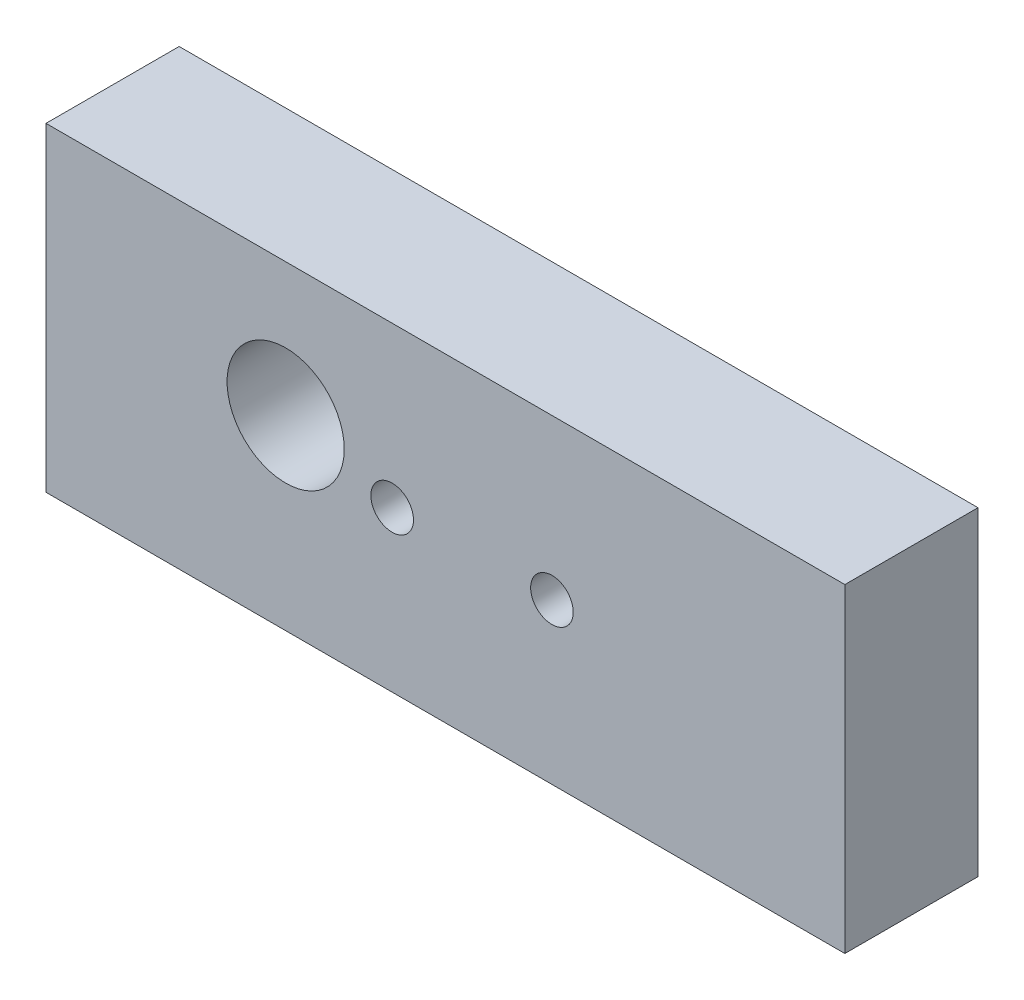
ISO-10303-21;
HEADER;
FILE_DESCRIPTION(('STEP AP214'),'2;1');
FILE_NAME('part.step','',(''),(''),'','','');
FILE_SCHEMA(('AUTOMOTIVE_DESIGN { 1 0 10303 214 1 1 1 1 }'));
ENDSEC;
DATA;
#1=APPLICATION_CONTEXT('core data for automotive mechanical design processes');
#2=APPLICATION_PROTOCOL_DEFINITION('international standard','automotive_design',2000,#1);
#3=PRODUCT_CONTEXT('',#1,'mechanical');
#4=PRODUCT('Part','Part','',(#3));
#5=PRODUCT_RELATED_PRODUCT_CATEGORY('part','',(#4));
#6=PRODUCT_DEFINITION_FORMATION('','',#4);
#7=PRODUCT_DEFINITION_CONTEXT('part definition',#1,'design');
#8=PRODUCT_DEFINITION('design','',#6,#7);
#9=PRODUCT_DEFINITION_SHAPE('','',#8);
#10=(LENGTH_UNIT() NAMED_UNIT(*) SI_UNIT(.MILLI.,.METRE.));
#11=(NAMED_UNIT(*) PLANE_ANGLE_UNIT() SI_UNIT($,.RADIAN.));
#12=(NAMED_UNIT(*) SI_UNIT($,.STERADIAN.) SOLID_ANGLE_UNIT());
#13=UNCERTAINTY_MEASURE_WITH_UNIT(LENGTH_MEASURE(1.E-05),#10,'distance_accuracy_value','');
#14=(GEOMETRIC_REPRESENTATION_CONTEXT(3) GLOBAL_UNCERTAINTY_ASSIGNED_CONTEXT((#13)) GLOBAL_UNIT_ASSIGNED_CONTEXT((#10,
#11,#12)) REPRESENTATION_CONTEXT('',''));
#15=CARTESIAN_POINT('',(0.,0.,0.));
#16=DIRECTION('',(0.,0.,1.));
#17=DIRECTION('',(1.,0.,0.));
#18=AXIS2_PLACEMENT_3D('',#15,#16,#17);
#19=CARTESIAN_POINT('',(0.,0.,-25.));
#20=DIRECTION('',(-1.,0.,0.));
#21=DIRECTION('',(0.,0.,1.));
#22=AXIS2_PLACEMENT_3D('',#19,#20,#21);
#23=PLANE('',#22);
#24=DIRECTION('',(0.,-1.,0.));
#25=VECTOR('',#24,1.);
#26=CARTESIAN_POINT('',(0.,0.,0.));
#27=LINE('',#26,#25);
#28=CARTESIAN_POINT('',(0.,60.,0.));
#29=VERTEX_POINT('',#28);
#30=CARTESIAN_POINT('',(0.,0.,0.));
#31=VERTEX_POINT('',#30);
#32=EDGE_CURVE('E102',#29,#31,#27,.T.);
#33=ORIENTED_EDGE('',*,*,#32,.F.);
#34=DIRECTION('',(0.,0.,1.));
#35=VECTOR('',#34,1.);
#36=CARTESIAN_POINT('',(0.,60.,-25.));
#37=LINE('',#36,#35);
#38=CARTESIAN_POINT('',(0.,60.,-25.));
#39=VERTEX_POINT('',#38);
#40=EDGE_CURVE('E11',#39,#29,#37,.T.);
#41=ORIENTED_EDGE('',*,*,#40,.F.);
#42=DIRECTION('',(0.,-1.,0.));
#43=VECTOR('',#42,1.);
#44=CARTESIAN_POINT('',(0.,0.,-25.));
#45=LINE('',#44,#43);
#46=CARTESIAN_POINT('',(0.,0.,-25.));
#47=VERTEX_POINT('',#46);
#48=EDGE_CURVE('E100',#39,#47,#45,.T.);
#49=ORIENTED_EDGE('',*,*,#48,.T.);
#50=DIRECTION('',(0.,0.,1.));
#51=VECTOR('',#50,1.);
#52=CARTESIAN_POINT('',(0.,0.,-25.));
#53=LINE('',#52,#51);
#54=EDGE_CURVE('E45',#47,#31,#53,.T.);
#55=ORIENTED_EDGE('',*,*,#54,.T.);
#56=EDGE_LOOP('',(#33,#41,#49,#55));
#57=FACE_BOUND('',#56,.T.);
#58=ADVANCED_FACE('F39',(#57),#23,.T.);
#59=CARTESIAN_POINT('',(0.,60.,-25.));
#60=DIRECTION('',(0.,1.,0.));
#61=DIRECTION('',(0.,0.,1.));
#62=AXIS2_PLACEMENT_3D('',#59,#60,#61);
#63=PLANE('',#62);
#64=DIRECTION('',(-1.,0.,0.));
#65=VECTOR('',#64,1.);
#66=CARTESIAN_POINT('',(0.,60.,0.));
#67=LINE('',#66,#65);
#68=CARTESIAN_POINT('',(150.,60.,0.));
#69=VERTEX_POINT('',#68);
#70=EDGE_CURVE('E97',#69,#29,#67,.T.);
#71=ORIENTED_EDGE('',*,*,#70,.F.);
#72=DIRECTION('',(0.,0.,1.));
#73=VECTOR('',#72,1.);
#74=CARTESIAN_POINT('',(150.,60.,-25.));
#75=LINE('',#74,#73);
#76=CARTESIAN_POINT('',(150.,60.,-25.));
#77=VERTEX_POINT('',#76);
#78=EDGE_CURVE('E48',#77,#69,#75,.T.);
#79=ORIENTED_EDGE('',*,*,#78,.F.);
#80=DIRECTION('',(-1.,0.,0.));
#81=VECTOR('',#80,1.);
#82=CARTESIAN_POINT('',(0.,60.,-25.));
#83=LINE('',#82,#81);
#84=EDGE_CURVE('E94',#77,#39,#83,.T.);
#85=ORIENTED_EDGE('',*,*,#84,.T.);
#86=ORIENTED_EDGE('',*,*,#40,.T.);
#87=EDGE_LOOP('',(#71,#79,#85,#86));
#88=FACE_BOUND('',#87,.T.);
#89=ADVANCED_FACE('F113',(#88),#63,.T.);
#90=CARTESIAN_POINT('',(150.,0.,-25.));
#91=DIRECTION('',(1.,0.,0.));
#92=DIRECTION('',(0.,0.,-1.));
#93=AXIS2_PLACEMENT_3D('',#90,#91,#92);
#94=PLANE('',#93);
#95=DIRECTION('',(0.,1.,0.));
#96=VECTOR('',#95,1.);
#97=CARTESIAN_POINT('',(150.,0.,0.));
#98=LINE('',#97,#96);
#99=CARTESIAN_POINT('',(150.,0.,0.));
#100=VERTEX_POINT('',#99);
#101=EDGE_CURVE('E90',#100,#69,#98,.T.);
#102=ORIENTED_EDGE('',*,*,#101,.F.);
#103=DIRECTION('',(0.,0.,1.));
#104=VECTOR('',#103,1.);
#105=CARTESIAN_POINT('',(150.,0.,-25.));
#106=LINE('',#105,#104);
#107=CARTESIAN_POINT('',(150.,0.,-25.));
#108=VERTEX_POINT('',#107);
#109=EDGE_CURVE('E82',#108,#100,#106,.T.);
#110=ORIENTED_EDGE('',*,*,#109,.F.);
#111=DIRECTION('',(0.,1.,0.));
#112=VECTOR('',#111,1.);
#113=CARTESIAN_POINT('',(150.,0.,-25.));
#114=LINE('',#113,#112);
#115=EDGE_CURVE('E87',#108,#77,#114,.T.);
#116=ORIENTED_EDGE('',*,*,#115,.T.);
#117=ORIENTED_EDGE('',*,*,#78,.T.);
#118=EDGE_LOOP('',(#102,#110,#116,#117));
#119=FACE_BOUND('',#118,.T.);
#120=ADVANCED_FACE('F88',(#119),#94,.T.);
#121=CARTESIAN_POINT('',(0.,0.,-25.));
#122=DIRECTION('',(0.,-1.,0.));
#123=DIRECTION('',(0.,0.,-1.));
#124=AXIS2_PLACEMENT_3D('',#121,#122,#123);
#125=PLANE('',#124);
#126=DIRECTION('',(1.,0.,0.));
#127=VECTOR('',#126,1.);
#128=CARTESIAN_POINT('',(0.,0.,0.));
#129=LINE('',#128,#127);
#130=EDGE_CURVE('E110',#31,#100,#129,.T.);
#131=ORIENTED_EDGE('',*,*,#130,.F.);
#132=ORIENTED_EDGE('',*,*,#54,.F.);
#133=DIRECTION('',(1.,0.,0.));
#134=VECTOR('',#133,1.);
#135=CARTESIAN_POINT('',(0.,0.,-25.));
#136=LINE('',#135,#134);
#137=EDGE_CURVE('E91',#47,#108,#136,.T.);
#138=ORIENTED_EDGE('',*,*,#137,.T.);
#139=ORIENTED_EDGE('',*,*,#109,.T.);
#140=EDGE_LOOP('',(#131,#132,#138,#139));
#141=FACE_BOUND('',#140,.T.);
#142=ADVANCED_FACE('F96',(#141),#125,.T.);
#143=CARTESIAN_POINT('',(0.,0.,-25.));
#144=DIRECTION('',(0.,0.,-1.));
#145=DIRECTION('',(-1.,0.,0.));
#146=AXIS2_PLACEMENT_3D('',#143,#144,#145);
#147=PLANE('',#146);
#148=ORIENTED_EDGE('',*,*,#48,.F.);
#149=ORIENTED_EDGE('',*,*,#84,.F.);
#150=ORIENTED_EDGE('',*,*,#115,.F.);
#151=ORIENTED_EDGE('',*,*,#137,.F.);
#152=EDGE_LOOP('',(#148,#149,#150,#151));
#153=FACE_BOUND('',#152,.T.);
#154=ADVANCED_FACE('F95',(#153),#147,.T.);
#155=CARTESIAN_POINT('',(0.,0.,0.));
#156=DIRECTION('',(0.,0.,-1.));
#157=DIRECTION('',(-1.,0.,0.));
#158=AXIS2_PLACEMENT_3D('',#155,#156,#157);
#159=PLANE('',#158);
#160=CARTESIAN_POINT('',(65.,30.,0.));
#161=DIRECTION('',(0.,0.,1.));
#162=DIRECTION('',(1.,0.,0.));
#163=AXIS2_PLACEMENT_3D('',#160,#161,#162);
#164=CIRCLE('',#163,4.00000000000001);
#165=CARTESIAN_POINT('',(69.,30.,0.));
#166=VERTEX_POINT('',#165);
#167=EDGE_CURVE('E162',#166,#166,#164,.T.);
#168=ORIENTED_EDGE('',*,*,#167,.F.);
#169=EDGE_LOOP('',(#168));
#170=FACE_BOUND('',#169,.T.);
#171=CARTESIAN_POINT('',(95.,30.,0.));
#172=DIRECTION('',(0.,0.,1.));
#173=DIRECTION('',(1.,0.,0.));
#174=AXIS2_PLACEMENT_3D('',#171,#172,#173);
#175=CIRCLE('',#174,4.00000000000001);
#176=CARTESIAN_POINT('',(99.,30.,0.));
#177=VERTEX_POINT('',#176);
#178=EDGE_CURVE('E170',#177,#177,#175,.T.);
#179=ORIENTED_EDGE('',*,*,#178,.F.);
#180=EDGE_LOOP('',(#179));
#181=FACE_BOUND('',#180,.T.);
#182=CARTESIAN_POINT('',(45.,35.,0.));
#183=DIRECTION('',(0.,0.,1.));
#184=DIRECTION('',(1.,0.,0.));
#185=AXIS2_PLACEMENT_3D('',#182,#183,#184);
#186=CIRCLE('',#185,11.);
#187=CARTESIAN_POINT('',(56.,35.,0.));
#188=VERTEX_POINT('',#187);
#189=EDGE_CURVE('E165',#188,#188,#186,.T.);
#190=ORIENTED_EDGE('',*,*,#189,.F.);
#191=EDGE_LOOP('',(#190));
#192=FACE_BOUND('',#191,.T.);
#193=ORIENTED_EDGE('',*,*,#32,.T.);
#194=ORIENTED_EDGE('',*,*,#130,.T.);
#195=ORIENTED_EDGE('',*,*,#101,.T.);
#196=ORIENTED_EDGE('',*,*,#70,.T.);
#197=EDGE_LOOP('',(#193,#194,#195,#196));
#198=FACE_BOUND('',#197,.T.);
#199=ADVANCED_FACE('F111',(#170,#181,#192,#198),#159,.F.);
#200=CARTESIAN_POINT('',(45.,35.,-20.));
#201=DIRECTION('',(0.,0.,1.));
#202=DIRECTION('',(1.,0.,0.));
#203=AXIS2_PLACEMENT_3D('',#200,#201,#202);
#204=CYLINDRICAL_SURFACE('',#203,11.);
#205=CARTESIAN_POINT('',(45.,35.,-20.));
#206=DIRECTION('',(0.,0.,1.));
#207=DIRECTION('',(1.,0.,0.));
#208=AXIS2_PLACEMENT_3D('',#205,#206,#207);
#209=CIRCLE('',#208,11.);
#210=CARTESIAN_POINT('',(56.,35.,-20.));
#211=VERTEX_POINT('',#210);
#212=EDGE_CURVE('E107',#211,#211,#209,.T.);
#213=ORIENTED_EDGE('',*,*,#212,.F.);
#214=EDGE_LOOP('',(#213));
#215=FACE_BOUND('',#214,.T.);
#216=ORIENTED_EDGE('',*,*,#189,.T.);
#217=EDGE_LOOP('',(#216));
#218=FACE_BOUND('',#217,.T.);
#219=ADVANCED_FACE('F133',(#215,#218),#204,.F.);
#220=CARTESIAN_POINT('',(45.,35.,-20.));
#221=DIRECTION('',(0.,0.,1.));
#222=DIRECTION('',(1.,0.,0.));
#223=AXIS2_PLACEMENT_3D('',#220,#221,#222);
#224=PLANE('',#223);
#225=ORIENTED_EDGE('',*,*,#212,.T.);
#226=EDGE_LOOP('',(#225));
#227=FACE_BOUND('',#226,.T.);
#228=ADVANCED_FACE('F140',(#227),#224,.T.);
#229=CARTESIAN_POINT('',(95.,30.,-20.));
#230=DIRECTION('',(0.,0.,1.));
#231=DIRECTION('',(1.,0.,0.));
#232=AXIS2_PLACEMENT_3D('',#229,#230,#231);
#233=CYLINDRICAL_SURFACE('',#232,4.00000000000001);
#234=CARTESIAN_POINT('',(95.,30.,-20.));
#235=DIRECTION('',(0.,0.,1.));
#236=DIRECTION('',(1.,0.,0.));
#237=AXIS2_PLACEMENT_3D('',#234,#235,#236);
#238=CIRCLE('',#237,4.00000000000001);
#239=CARTESIAN_POINT('',(99.,30.,-20.));
#240=VERTEX_POINT('',#239);
#241=EDGE_CURVE('E175',#240,#240,#238,.T.);
#242=ORIENTED_EDGE('',*,*,#241,.F.);
#243=EDGE_LOOP('',(#242));
#244=FACE_BOUND('',#243,.T.);
#245=ORIENTED_EDGE('',*,*,#178,.T.);
#246=EDGE_LOOP('',(#245));
#247=FACE_BOUND('',#246,.T.);
#248=ADVANCED_FACE('F143',(#244,#247),#233,.F.);
#249=CARTESIAN_POINT('',(95.,30.,-20.));
#250=DIRECTION('',(0.,0.,1.));
#251=DIRECTION('',(1.,0.,0.));
#252=AXIS2_PLACEMENT_3D('',#249,#250,#251);
#253=PLANE('',#252);
#254=ORIENTED_EDGE('',*,*,#241,.T.);
#255=EDGE_LOOP('',(#254));
#256=FACE_BOUND('',#255,.T.);
#257=ADVANCED_FACE('F141',(#256),#253,.T.);
#258=CARTESIAN_POINT('',(65.,30.,-20.));
#259=DIRECTION('',(0.,0.,1.));
#260=DIRECTION('',(1.,0.,0.));
#261=AXIS2_PLACEMENT_3D('',#258,#259,#260);
#262=CYLINDRICAL_SURFACE('',#261,4.00000000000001);
#263=CARTESIAN_POINT('',(65.,30.,-20.));
#264=DIRECTION('',(0.,0.,1.));
#265=DIRECTION('',(1.,0.,0.));
#266=AXIS2_PLACEMENT_3D('',#263,#264,#265);
#267=CIRCLE('',#266,4.00000000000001);
#268=CARTESIAN_POINT('',(69.,30.,-20.));
#269=VERTEX_POINT('',#268);
#270=EDGE_CURVE('E161',#269,#269,#267,.T.);
#271=ORIENTED_EDGE('',*,*,#270,.F.);
#272=EDGE_LOOP('',(#271));
#273=FACE_BOUND('',#272,.T.);
#274=ORIENTED_EDGE('',*,*,#167,.T.);
#275=EDGE_LOOP('',(#274));
#276=FACE_BOUND('',#275,.T.);
#277=ADVANCED_FACE('F148',(#273,#276),#262,.F.);
#278=CARTESIAN_POINT('',(65.,30.,-20.));
#279=DIRECTION('',(0.,0.,1.));
#280=DIRECTION('',(1.,0.,0.));
#281=AXIS2_PLACEMENT_3D('',#278,#279,#280);
#282=PLANE('',#281);
#283=ORIENTED_EDGE('',*,*,#270,.T.);
#284=EDGE_LOOP('',(#283));
#285=FACE_BOUND('',#284,.T.);
#286=ADVANCED_FACE('F153',(#285),#282,.T.);
#287=CLOSED_SHELL('',(#58,#89,#120,#142,#154,#199,#219,#228,#248,#257,#277,#286));
#288=MANIFOLD_SOLID_BREP('B2',#287);
#289=ADVANCED_BREP_SHAPE_REPRESENTATION('',(#18,#288),#14);
#290=SHAPE_DEFINITION_REPRESENTATION(#9,#289);
ENDSEC;
END-ISO-10303-21;
